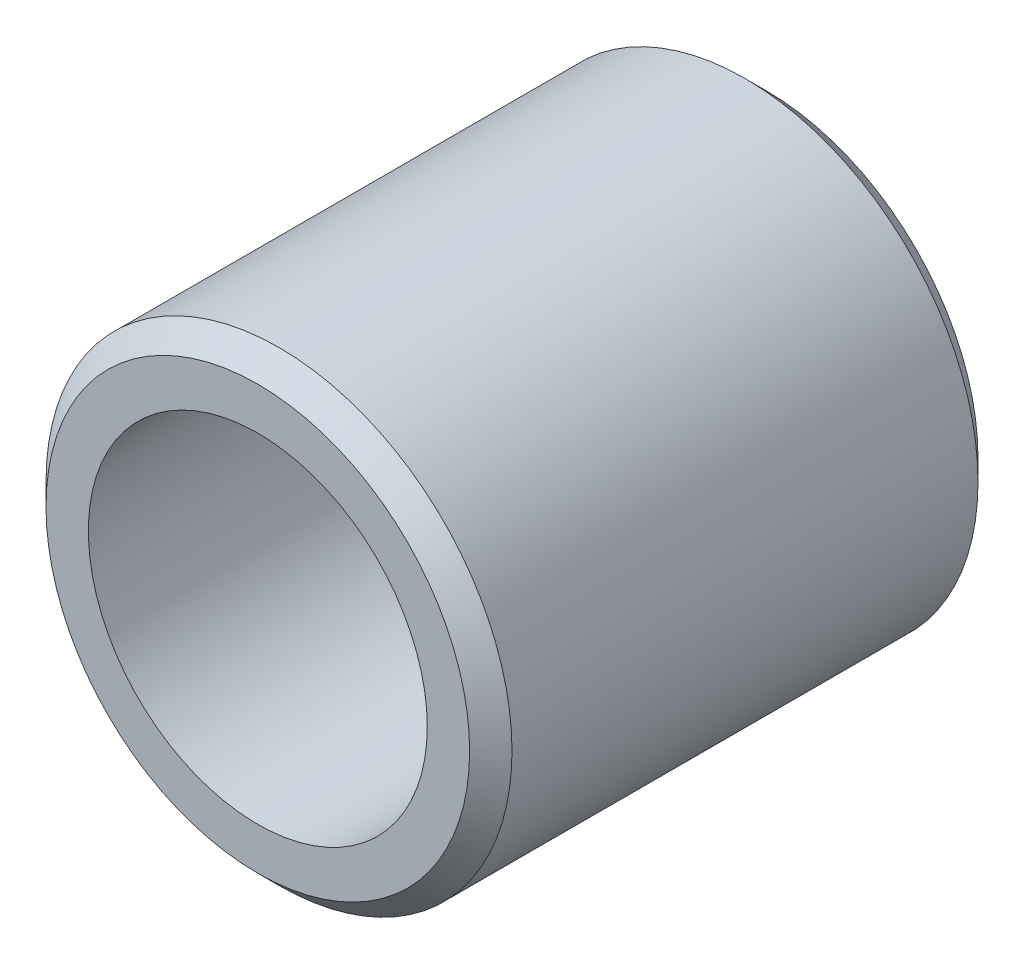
from build123d import *

# Parameters (mm, degrees)
ESQUISSE1_R          = 2.75
ESQUISSE1_R_2        = 2
BASE_EXTRUSION_DEPTH = 6
CHANFREIN1_SIZE      = 0.25


with BuildPart() as part:
    # Esquisse1 → Base-Extrusion (new body)
    with BuildSketch(Plane.XY):
        Circle(ESQUISSE1_R)
        Circle(ESQUISSE1_R_2, mode=Mode.SUBTRACT)
    extrude(amount=BASE_EXTRUSION_DEPTH)

    # Chanfrein1
    chanfrein1_edges = [part.edges().sort_by_distance(p)[0] for p in [
        (-2.75, 0, 0),
        (-2.75, 0, 6),
    ]]
    chamfer(chanfrein1_edges, length=CHANFREIN1_SIZE)


solid = part.part
